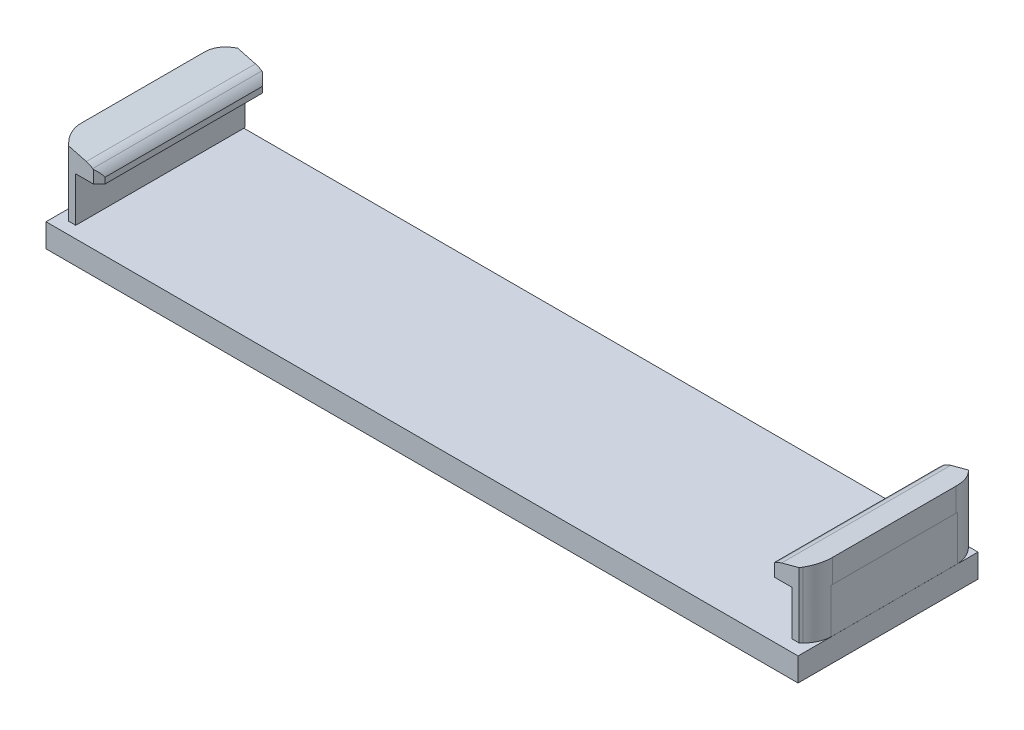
ISO-10303-21;
HEADER;
FILE_DESCRIPTION(('STEP AP214'),'2;1');
FILE_NAME('part.step','',(''),(''),'','','');
FILE_SCHEMA(('AUTOMOTIVE_DESIGN { 1 0 10303 214 1 1 1 1 }'));
ENDSEC;
DATA;
#1=APPLICATION_CONTEXT('core data for automotive mechanical design processes');
#2=APPLICATION_PROTOCOL_DEFINITION('international standard','automotive_design',2000,#1);
#3=PRODUCT_CONTEXT('',#1,'mechanical');
#4=PRODUCT('Part','Part','',(#3));
#5=PRODUCT_RELATED_PRODUCT_CATEGORY('part','',(#4));
#6=PRODUCT_DEFINITION_FORMATION('','',#4);
#7=PRODUCT_DEFINITION_CONTEXT('part definition',#1,'design');
#8=PRODUCT_DEFINITION('design','',#6,#7);
#9=PRODUCT_DEFINITION_SHAPE('','',#8);
#10=(LENGTH_UNIT() NAMED_UNIT(*) SI_UNIT(.MILLI.,.METRE.));
#11=(NAMED_UNIT(*) PLANE_ANGLE_UNIT() SI_UNIT($,.RADIAN.));
#12=(NAMED_UNIT(*) SI_UNIT($,.STERADIAN.) SOLID_ANGLE_UNIT());
#13=UNCERTAINTY_MEASURE_WITH_UNIT(LENGTH_MEASURE(1.E-05),#10,'distance_accuracy_value','');
#14=(GEOMETRIC_REPRESENTATION_CONTEXT(3) GLOBAL_UNCERTAINTY_ASSIGNED_CONTEXT((#13)) GLOBAL_UNIT_ASSIGNED_CONTEXT((#10,
#11,#12)) REPRESENTATION_CONTEXT('',''));
#15=CARTESIAN_POINT('',(0.,0.,0.));
#16=DIRECTION('',(0.,0.,1.));
#17=DIRECTION('',(1.,0.,0.));
#18=AXIS2_PLACEMENT_3D('',#15,#16,#17);
#19=CARTESIAN_POINT('',(32.0000015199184,3.,0.));
#20=DIRECTION('',(0.,0.,1.));
#21=DIRECTION('',(1.,0.,0.));
#22=AXIS2_PLACEMENT_3D('',#19,#20,#21);
#23=PLANE('',#22);
#24=DIRECTION('',(0.,-1.,0.));
#25=VECTOR('',#24,1.);
#26=CARTESIAN_POINT('',(31.0999993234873,8.79998955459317,0.));
#27=LINE('',#26,#25);
#28=CARTESIAN_POINT('',(31.0999993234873,8.55883867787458,0.));
#29=VERTEX_POINT('',#28);
#30=CARTESIAN_POINT('',(31.0999993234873,3.,0.));
#31=VERTEX_POINT('',#30);
#32=EDGE_CURVE('E514',#29,#31,#27,.T.);
#33=ORIENTED_EDGE('',*,*,#32,.T.);
#34=DIRECTION('',(-1.,0.,0.));
#35=VECTOR('',#34,1.);
#36=CARTESIAN_POINT('',(32.0000015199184,3.,0.));
#37=LINE('',#36,#35);
#38=CARTESIAN_POINT('',(30.5000003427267,3.,0.));
#39=VERTEX_POINT('',#38);
#40=EDGE_CURVE('E487',#31,#39,#37,.T.);
#41=ORIENTED_EDGE('',*,*,#40,.T.);
#42=DIRECTION('',(0.,-1.,0.));
#43=VECTOR('',#42,1.);
#44=CARTESIAN_POINT('',(30.5000003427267,6.8,0.));
#45=LINE('',#44,#43);
#46=CARTESIAN_POINT('',(30.5000003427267,6.80000009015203,0.));
#47=VERTEX_POINT('',#46);
#48=EDGE_CURVE('E318',#47,#39,#45,.T.);
#49=ORIENTED_EDGE('',*,*,#48,.F.);
#50=DIRECTION('',(1.,0.,0.));
#51=VECTOR('',#50,1.);
#52=CARTESIAN_POINT('',(32.0000015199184,6.80000009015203,0.));
#53=LINE('',#52,#51);
#54=CARTESIAN_POINT('',(28.999999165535,6.80000009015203,0.));
#55=VERTEX_POINT('',#54);
#56=EDGE_CURVE('E539',#55,#47,#53,.T.);
#57=ORIENTED_EDGE('',*,*,#56,.F.);
#58=DIRECTION('',(0.,-1.,0.));
#59=VECTOR('',#58,1.);
#60=CARTESIAN_POINT('',(28.999999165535,8.79998955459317,0.));
#61=LINE('',#60,#59);
#62=CARTESIAN_POINT('',(28.999999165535,7.86790985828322,0.));
#63=VERTEX_POINT('',#62);
#64=EDGE_CURVE('E497',#63,#55,#61,.T.);
#65=ORIENTED_EDGE('',*,*,#64,.F.);
#66=CARTESIAN_POINT('',(30.0633864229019,6.42762273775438,0.));
#67=DIRECTION('',(0.,0.,1.));
#68=DIRECTION('',(-1.,0.,0.));
#69=AXIS2_PLACEMENT_3D('',#66,#67,#68);
#70=CIRCLE('',#69,1.79031266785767);
#71=CARTESIAN_POINT('',(29.0544796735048,7.9065840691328,0.));
#72=VERTEX_POINT('',#71);
#73=EDGE_CURVE('E547',#72,#63,#70,.T.);
#74=ORIENTED_EDGE('',*,*,#73,.F.);
#75=CARTESIAN_POINT('',(30.0633373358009,6.42769469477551,0.));
#76=DIRECTION('',(0.,0.,1.));
#77=DIRECTION('',(-1.,0.,0.));
#78=AXIS2_PLACEMENT_3D('',#75,#76,#77);
#79=CIRCLE('',#78,1.79022556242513);
#80=CARTESIAN_POINT('',(29.6000000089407,8.1569217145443,0.));
#81=VERTEX_POINT('',#80);
#82=EDGE_CURVE('E304',#81,#72,#79,.T.);
#83=ORIENTED_EDGE('',*,*,#82,.F.);
#84=DIRECTION('',(-0.965926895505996,-0.258815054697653,0.));
#85=VECTOR('',#84,1.);
#86=CARTESIAN_POINT('',(29.6000000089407,8.1569217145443,0.));
#87=LINE('',#86,#85);
#88=EDGE_CURVE('E299',#29,#81,#87,.T.);
#89=ORIENTED_EDGE('',*,*,#88,.F.);
#90=EDGE_LOOP('',(#33,#41,#49,#57,#65,#74,#83,#89));
#91=FACE_BOUND('',#90,.T.);
#92=ADVANCED_FACE('F46',(#91),#23,.F.);
#93=CARTESIAN_POINT('',(32.0000015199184,3.,14.3999997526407));
#94=DIRECTION('',(0.,0.,-1.));
#95=DIRECTION('',(-1.,0.,0.));
#96=AXIS2_PLACEMENT_3D('',#93,#94,#95);
#97=PLANE('',#96);
#98=DIRECTION('',(0.,-1.,0.));
#99=VECTOR('',#98,1.);
#100=CARTESIAN_POINT('',(-31.0999993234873,8.79998955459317,14.3999997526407));
#101=LINE('',#100,#99);
#102=CARTESIAN_POINT('',(-31.0999993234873,8.55883867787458,14.3999997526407));
#103=VERTEX_POINT('',#102);
#104=CARTESIAN_POINT('',(-31.0999993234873,3.,14.3999997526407));
#105=VERTEX_POINT('',#104);
#106=EDGE_CURVE('E344',#103,#105,#101,.T.);
#107=ORIENTED_EDGE('',*,*,#106,.T.);
#108=DIRECTION('',(1.,0.,0.));
#109=VECTOR('',#108,1.);
#110=CARTESIAN_POINT('',(32.0000015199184,3.,14.3999997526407));
#111=LINE('',#110,#109);
#112=CARTESIAN_POINT('',(-30.5000003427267,3.,14.3999997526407));
#113=VERTEX_POINT('',#112);
#114=EDGE_CURVE('E489',#105,#113,#111,.T.);
#115=ORIENTED_EDGE('',*,*,#114,.T.);
#116=DIRECTION('',(0.,-1.,0.));
#117=VECTOR('',#116,1.);
#118=CARTESIAN_POINT('',(-30.5000003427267,6.8,14.3999997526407));
#119=LINE('',#118,#117);
#120=CARTESIAN_POINT('',(-30.5000003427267,6.8,14.3999997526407));
#121=VERTEX_POINT('',#120);
#122=EDGE_CURVE('E428',#121,#113,#119,.T.);
#123=ORIENTED_EDGE('',*,*,#122,.F.);
#124=DIRECTION('',(1.,0.,0.));
#125=VECTOR('',#124,1.);
#126=CARTESIAN_POINT('',(-32.0000015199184,6.80000009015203,14.3999997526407));
#127=LINE('',#126,#125);
#128=CARTESIAN_POINT('',(-28.999999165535,6.80000009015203,14.3999997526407));
#129=VERTEX_POINT('',#128);
#130=EDGE_CURVE('E389',#121,#129,#127,.T.);
#131=ORIENTED_EDGE('',*,*,#130,.T.);
#132=DIRECTION('',(0.,-1.,0.));
#133=VECTOR('',#132,1.);
#134=CARTESIAN_POINT('',(-28.999999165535,8.79998955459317,14.3999997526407));
#135=LINE('',#134,#133);
#136=CARTESIAN_POINT('',(-28.999999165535,7.86790985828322,14.3999997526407));
#137=VERTEX_POINT('',#136);
#138=EDGE_CURVE('E330',#137,#129,#135,.T.);
#139=ORIENTED_EDGE('',*,*,#138,.F.);
#140=CARTESIAN_POINT('',(-30.0633864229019,6.42762273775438,14.3999997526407));
#141=DIRECTION('',(0.,0.,-1.));
#142=DIRECTION('',(-1.,0.,0.));
#143=AXIS2_PLACEMENT_3D('',#140,#141,#142);
#144=CIRCLE('',#143,1.79031266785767);
#145=CARTESIAN_POINT('',(-29.0544796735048,7.9065840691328,14.3999997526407));
#146=VERTEX_POINT('',#145);
#147=EDGE_CURVE('E386',#137,#146,#144,.F.);
#148=ORIENTED_EDGE('',*,*,#147,.T.);
#149=CARTESIAN_POINT('',(-30.0633373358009,6.42769469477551,14.3999997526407));
#150=DIRECTION('',(0.,0.,-1.));
#151=DIRECTION('',(-1.,0.,0.));
#152=AXIS2_PLACEMENT_3D('',#149,#150,#151);
#153=CIRCLE('',#152,1.79022556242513);
#154=CARTESIAN_POINT('',(-29.6000000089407,8.1569217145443,14.3999997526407));
#155=VERTEX_POINT('',#154);
#156=EDGE_CURVE('E384',#146,#155,#153,.F.);
#157=ORIENTED_EDGE('',*,*,#156,.T.);
#158=DIRECTION('',(-0.965926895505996,0.258815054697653,0.));
#159=VECTOR('',#158,1.);
#160=CARTESIAN_POINT('',(-29.6000000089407,8.1569217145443,14.3999997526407));
#161=LINE('',#160,#159);
#162=EDGE_CURVE('E392',#155,#103,#161,.T.);
#163=ORIENTED_EDGE('',*,*,#162,.T.);
#164=EDGE_LOOP('',(#107,#115,#123,#131,#139,#148,#157,#163));
#165=FACE_BOUND('',#164,.T.);
#166=ADVANCED_FACE('F682',(#165),#97,.F.);
#167=DIRECTION('',(0.,-1.,0.));
#168=VECTOR('',#167,1.);
#169=CARTESIAN_POINT('',(-30.5000003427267,6.8,0.));
#170=LINE('',#169,#168);
#171=CARTESIAN_POINT('',(-30.5000003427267,6.8,0.));
#172=VERTEX_POINT('',#171);
#173=CARTESIAN_POINT('',(-30.5000003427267,3.,0.));
#174=VERTEX_POINT('',#173);
#175=EDGE_CURVE('E435',#172,#174,#170,.T.);
#176=ORIENTED_EDGE('',*,*,#175,.T.);
#177=CARTESIAN_POINT('',(-31.0999993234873,3.,0.));
#178=VERTEX_POINT('',#177);
#179=EDGE_CURVE('E491',#174,#178,#37,.T.);
#180=ORIENTED_EDGE('',*,*,#179,.T.);
#181=DIRECTION('',(0.,-1.,0.));
#182=VECTOR('',#181,1.);
#183=CARTESIAN_POINT('',(-31.0999993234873,8.79998955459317,0.));
#184=LINE('',#183,#182);
#185=CARTESIAN_POINT('',(-31.0999993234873,8.55883867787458,0.));
#186=VERTEX_POINT('',#185);
#187=EDGE_CURVE('E355',#186,#178,#184,.T.);
#188=ORIENTED_EDGE('',*,*,#187,.F.);
#189=DIRECTION('',(0.965926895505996,-0.258815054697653,0.));
#190=VECTOR('',#189,1.);
#191=CARTESIAN_POINT('',(-29.6000000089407,8.1569217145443,0.));
#192=LINE('',#191,#190);
#193=CARTESIAN_POINT('',(-29.6000000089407,8.1569217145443,0.));
#194=VERTEX_POINT('',#193);
#195=EDGE_CURVE('E383',#186,#194,#192,.T.);
#196=ORIENTED_EDGE('',*,*,#195,.T.);
#197=CARTESIAN_POINT('',(-30.0633373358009,6.42769469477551,0.));
#198=DIRECTION('',(0.,0.,-1.));
#199=DIRECTION('',(1.,0.,0.));
#200=AXIS2_PLACEMENT_3D('',#197,#198,#199);
#201=CIRCLE('',#200,1.79022556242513);
#202=CARTESIAN_POINT('',(-29.0544796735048,7.9065840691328,0.));
#203=VERTEX_POINT('',#202);
#204=EDGE_CURVE('E394',#194,#203,#201,.T.);
#205=ORIENTED_EDGE('',*,*,#204,.T.);
#206=CARTESIAN_POINT('',(-30.0633864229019,6.42762273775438,0.));
#207=DIRECTION('',(0.,0.,-1.));
#208=DIRECTION('',(1.,0.,0.));
#209=AXIS2_PLACEMENT_3D('',#206,#207,#208);
#210=CIRCLE('',#209,1.79031266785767);
#211=CARTESIAN_POINT('',(-28.999999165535,7.86790985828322,0.));
#212=VERTEX_POINT('',#211);
#213=EDGE_CURVE('E397',#203,#212,#210,.T.);
#214=ORIENTED_EDGE('',*,*,#213,.T.);
#215=DIRECTION('',(0.,-1.,0.));
#216=VECTOR('',#215,1.);
#217=CARTESIAN_POINT('',(-28.999999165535,8.79998955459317,0.));
#218=LINE('',#217,#216);
#219=CARTESIAN_POINT('',(-28.999999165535,6.80000009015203,0.));
#220=VERTEX_POINT('',#219);
#221=EDGE_CURVE('E333',#212,#220,#218,.T.);
#222=ORIENTED_EDGE('',*,*,#221,.T.);
#223=DIRECTION('',(-1.,0.,0.));
#224=VECTOR('',#223,1.);
#225=CARTESIAN_POINT('',(-32.0000015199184,6.80000009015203,0.));
#226=LINE('',#225,#224);
#227=EDGE_CURVE('E400',#220,#172,#226,.T.);
#228=ORIENTED_EDGE('',*,*,#227,.T.);
#229=EDGE_LOOP('',(#176,#180,#188,#196,#205,#214,#222,#228));
#230=FACE_BOUND('',#229,.T.);
#231=ADVANCED_FACE('F684',(#230),#23,.F.);
#232=DIRECTION('',(0.,-1.,0.));
#233=VECTOR('',#232,1.);
#234=CARTESIAN_POINT('',(30.5000003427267,6.8,14.3999997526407));
#235=LINE('',#234,#233);
#236=CARTESIAN_POINT('',(30.5000003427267,6.8,14.3999997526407));
#237=VERTEX_POINT('',#236);
#238=CARTESIAN_POINT('',(30.5000003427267,3.,14.3999997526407));
#239=VERTEX_POINT('',#238);
#240=EDGE_CURVE('E327',#237,#239,#235,.T.);
#241=ORIENTED_EDGE('',*,*,#240,.T.);
#242=CARTESIAN_POINT('',(31.0999993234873,3.,14.3999997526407));
#243=VERTEX_POINT('',#242);
#244=EDGE_CURVE('E492',#239,#243,#111,.T.);
#245=ORIENTED_EDGE('',*,*,#244,.T.);
#246=DIRECTION('',(0.,-1.,0.));
#247=VECTOR('',#246,1.);
#248=CARTESIAN_POINT('',(31.0999993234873,8.79998955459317,14.3999997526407));
#249=LINE('',#248,#247);
#250=CARTESIAN_POINT('',(31.0999993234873,8.55883867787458,14.3999997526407));
#251=VERTEX_POINT('',#250);
#252=EDGE_CURVE('E292',#251,#243,#249,.T.);
#253=ORIENTED_EDGE('',*,*,#252,.F.);
#254=DIRECTION('',(0.965926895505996,0.258815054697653,0.));
#255=VECTOR('',#254,1.);
#256=CARTESIAN_POINT('',(29.6000000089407,8.1569217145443,14.3999997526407));
#257=LINE('',#256,#255);
#258=CARTESIAN_POINT('',(29.6000000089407,8.1569217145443,14.3999997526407));
#259=VERTEX_POINT('',#258);
#260=EDGE_CURVE('E322',#259,#251,#257,.T.);
#261=ORIENTED_EDGE('',*,*,#260,.F.);
#262=CARTESIAN_POINT('',(30.0633373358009,6.42769469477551,14.3999997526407));
#263=DIRECTION('',(0.,0.,-1.));
#264=DIRECTION('',(-1.,0.,0.));
#265=AXIS2_PLACEMENT_3D('',#262,#263,#264);
#266=CIRCLE('',#265,1.79022556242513);
#267=CARTESIAN_POINT('',(29.0544796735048,7.9065840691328,14.3999997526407));
#268=VERTEX_POINT('',#267);
#269=EDGE_CURVE('E541',#268,#259,#266,.T.);
#270=ORIENTED_EDGE('',*,*,#269,.F.);
#271=CARTESIAN_POINT('',(30.0633864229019,6.42762273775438,14.3999997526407));
#272=DIRECTION('',(0.,0.,-1.));
#273=DIRECTION('',(-1.,0.,0.));
#274=AXIS2_PLACEMENT_3D('',#271,#272,#273);
#275=CIRCLE('',#274,1.79031266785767);
#276=CARTESIAN_POINT('',(28.999999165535,7.86790985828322,14.3999997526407));
#277=VERTEX_POINT('',#276);
#278=EDGE_CURVE('E311',#277,#268,#275,.T.);
#279=ORIENTED_EDGE('',*,*,#278,.F.);
#280=DIRECTION('',(0.,-1.,0.));
#281=VECTOR('',#280,1.);
#282=CARTESIAN_POINT('',(28.999999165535,8.79998955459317,14.3999997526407));
#283=LINE('',#282,#281);
#284=CARTESIAN_POINT('',(28.999999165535,6.80000009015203,14.3999997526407));
#285=VERTEX_POINT('',#284);
#286=EDGE_CURVE('E63',#277,#285,#283,.T.);
#287=ORIENTED_EDGE('',*,*,#286,.T.);
#288=DIRECTION('',(-1.,0.,0.));
#289=VECTOR('',#288,1.);
#290=CARTESIAN_POINT('',(32.0000015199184,6.80000009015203,14.3999997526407));
#291=LINE('',#290,#289);
#292=EDGE_CURVE('E308',#237,#285,#291,.T.);
#293=ORIENTED_EDGE('',*,*,#292,.F.);
#294=EDGE_LOOP('',(#241,#245,#253,#261,#270,#279,#287,#293));
#295=FACE_BOUND('',#294,.T.);
#296=ADVANCED_FACE('F579',(#295),#97,.F.);
#297=CARTESIAN_POINT('',(-31.9968168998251,6.8,14.3999997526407));
#298=DIRECTION('',(1.,0.,0.));
#299=DIRECTION('',(0.,0.,-1.));
#300=AXIS2_PLACEMENT_3D('',#297,#298,#299);
#301=PLANE('',#300);
#302=DIRECTION('',(0.,-1.,0.));
#303=VECTOR('',#302,1.);
#304=CARTESIAN_POINT('',(-31.9968168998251,8.79998955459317,12.5906058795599));
#305=LINE('',#304,#303);
#306=CARTESIAN_POINT('',(-31.9968168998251,6.80000009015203,12.5906058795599));
#307=VERTEX_POINT('',#306);
#308=CARTESIAN_POINT('',(-31.9968168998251,3.,12.5906058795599));
#309=VERTEX_POINT('',#308);
#310=EDGE_CURVE('E369',#307,#309,#305,.T.);
#311=ORIENTED_EDGE('',*,*,#310,.F.);
#312=DIRECTION('',(0.,0.,1.));
#313=VECTOR('',#312,1.);
#314=CARTESIAN_POINT('',(-31.9968168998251,6.8,14.3999997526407));
#315=LINE('',#314,#313);
#316=CARTESIAN_POINT('',(-31.9968168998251,6.80000009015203,1.80938703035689));
#317=VERTEX_POINT('',#316);
#318=EDGE_CURVE('E424',#317,#307,#315,.T.);
#319=ORIENTED_EDGE('',*,*,#318,.F.);
#320=DIRECTION('',(0.,-1.,0.));
#321=VECTOR('',#320,1.);
#322=CARTESIAN_POINT('',(-31.9968168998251,8.79998955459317,1.80938703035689));
#323=LINE('',#322,#321);
#324=CARTESIAN_POINT('',(-31.9968168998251,3.,1.80938703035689));
#325=VERTEX_POINT('',#324);
#326=EDGE_CURVE('E364',#325,#317,#323,.F.);
#327=ORIENTED_EDGE('',*,*,#326,.F.);
#328=DIRECTION('',(0.,0.,1.));
#329=VECTOR('',#328,1.);
#330=CARTESIAN_POINT('',(-31.9968168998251,3.,14.3999997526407));
#331=LINE('',#330,#329);
#332=EDGE_CURVE('E425',#325,#309,#331,.T.);
#333=ORIENTED_EDGE('',*,*,#332,.T.);
#334=EDGE_LOOP('',(#311,#319,#327,#333));
#335=FACE_BOUND('',#334,.T.);
#336=ADVANCED_FACE('F698',(#335),#301,.F.);
#337=CARTESIAN_POINT('',(-32.0000015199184,6.80000009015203,18.4311247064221));
#338=DIRECTION('',(0.,-1.,0.));
#339=DIRECTION('',(0.,0.,-1.));
#340=AXIS2_PLACEMENT_3D('',#337,#338,#339);
#341=PLANE('',#340);
#342=ORIENTED_EDGE('',*,*,#227,.F.);
#343=DIRECTION('',(0.707106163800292,0.,0.707107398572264));
#344=VECTOR('',#343,1.);
#345=CARTESIAN_POINT('',(-21.2844353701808,6.80000009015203,7.71557726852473));
#346=LINE('',#345,#344);
#347=CARTESIAN_POINT('',(-28.5000000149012,6.80000009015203,0.500000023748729));
#348=VERTEX_POINT('',#347);
#349=EDGE_CURVE('E380',#220,#348,#346,.T.);
#350=ORIENTED_EDGE('',*,*,#349,.T.);
#351=DIRECTION('',(0.,0.,-1.));
#352=VECTOR('',#351,1.);
#353=CARTESIAN_POINT('',(-28.5000000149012,6.80000009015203,18.4311247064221));
#354=LINE('',#353,#352);
#355=CARTESIAN_POINT('',(-28.5000000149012,6.80000009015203,13.9000006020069));
#356=VERTEX_POINT('',#355);
#357=EDGE_CURVE('E405',#356,#348,#354,.T.);
#358=ORIENTED_EDGE('',*,*,#357,.F.);
#359=DIRECTION('',(-0.707106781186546,0.,0.707106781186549));
#360=VECTOR('',#359,1.);
#361=CARTESIAN_POINT('',(-32.5155628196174,6.80000009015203,17.9155634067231));
#362=LINE('',#361,#360);
#363=EDGE_CURVE('E374',#356,#129,#362,.T.);
#364=ORIENTED_EDGE('',*,*,#363,.T.);
#365=ORIENTED_EDGE('',*,*,#130,.F.);
#366=DIRECTION('',(0.,0.,-1.));
#367=VECTOR('',#366,1.);
#368=CARTESIAN_POINT('',(-30.5000003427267,6.8,14.3999997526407));
#369=LINE('',#368,#367);
#370=EDGE_CURVE('E421',#121,#172,#369,.T.);
#371=ORIENTED_EDGE('',*,*,#370,.T.);
#372=EDGE_LOOP('',(#342,#350,#358,#364,#365,#371));
#373=FACE_BOUND('',#372,.T.);
#374=ADVANCED_FACE('F710',(#373),#341,.T.);
#375=CARTESIAN_POINT('',(-32.0000015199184,8.79998955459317,18.4311247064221));
#376=DIRECTION('',(-1.,0.,0.));
#377=DIRECTION('',(0.,0.,1.));
#378=AXIS2_PLACEMENT_3D('',#375,#376,#377);
#379=PLANE('',#378);
#380=DIRECTION('',(0.,0.,-1.));
#381=VECTOR('',#380,1.);
#382=CARTESIAN_POINT('',(-32.0000015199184,6.80000009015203,18.4311247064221));
#383=LINE('',#382,#381);
#384=CARTESIAN_POINT('',(-32.0000015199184,6.80000009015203,12.4644665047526));
#385=VERTEX_POINT('',#384);
#386=CARTESIAN_POINT('',(-32.0000015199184,6.80000009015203,1.93553394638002));
#387=VERTEX_POINT('',#386);
#388=EDGE_CURVE('E387',#385,#387,#383,.T.);
#389=ORIENTED_EDGE('',*,*,#388,.F.);
#390=DIRECTION('',(0.,-1.,0.));
#391=VECTOR('',#390,1.);
#392=CARTESIAN_POINT('',(-32.0000015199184,8.79998955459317,12.4644665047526));
#393=LINE('',#392,#391);
#394=CARTESIAN_POINT('',(-32.0000015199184,8.79998955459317,12.4644665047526));
#395=VERTEX_POINT('',#394);
#396=EDGE_CURVE('E336',#395,#385,#393,.T.);
#397=ORIENTED_EDGE('',*,*,#396,.F.);
#398=DIRECTION('',(0.,0.,-1.));
#399=VECTOR('',#398,1.);
#400=CARTESIAN_POINT('',(-32.0000015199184,8.79998955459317,18.4311247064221));
#401=LINE('',#400,#399);
#402=CARTESIAN_POINT('',(-32.0000015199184,8.79998955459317,1.93553394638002));
#403=VERTEX_POINT('',#402);
#404=EDGE_CURVE('E402',#395,#403,#401,.T.);
#405=ORIENTED_EDGE('',*,*,#404,.T.);
#406=DIRECTION('',(0.,-1.,0.));
#407=VECTOR('',#406,1.);
#408=CARTESIAN_POINT('',(-32.0000015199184,8.79998955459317,1.93553394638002));
#409=LINE('',#408,#407);
#410=EDGE_CURVE('E352',#403,#387,#409,.T.);
#411=ORIENTED_EDGE('',*,*,#410,.T.);
#412=EDGE_LOOP('',(#389,#397,#405,#411));
#413=FACE_BOUND('',#412,.T.);
#414=ADVANCED_FACE('F732',(#413),#379,.T.);
#415=ORIENTED_EDGE('',*,*,#318,.T.);
#416=CARTESIAN_POINT('',(-29.4999903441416,6.80000009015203,12.464459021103));
#417=DIRECTION('',(0.,-1.,0.));
#418=DIRECTION('',(0.,0.,-1.));
#419=AXIS2_PLACEMENT_3D('',#416,#417,#418);
#420=CIRCLE('',#419,2.500011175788);
#421=EDGE_CURVE('E366',#307,#385,#420,.T.);
#422=ORIENTED_EDGE('',*,*,#421,.T.);
#423=ORIENTED_EDGE('',*,*,#388,.T.);
#424=CARTESIAN_POINT('',(-29.5000088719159,6.80000009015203,1.93553342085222));
#425=DIRECTION('',(0.,-1.,0.));
#426=DIRECTION('',(0.,0.,-1.));
#427=AXIS2_PLACEMENT_3D('',#424,#425,#426);
#428=CIRCLE('',#427,2.4999926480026);
#429=EDGE_CURVE('E361',#387,#317,#428,.T.);
#430=ORIENTED_EDGE('',*,*,#429,.T.);
#431=EDGE_LOOP('',(#415,#422,#423,#430));
#432=FACE_BOUND('',#431,.T.);
#433=ADVANCED_FACE('F726',(#432),#341,.T.);
#434=CARTESIAN_POINT('',(-28.5000000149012,6.80000009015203,18.4311247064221));
#435=DIRECTION('',(1.,0.,0.));
#436=DIRECTION('',(0.,0.,-1.));
#437=AXIS2_PLACEMENT_3D('',#434,#435,#436);
#438=PLANE('',#437);
#439=ORIENTED_EDGE('',*,*,#357,.T.);
#440=DIRECTION('',(0.,1.,0.));
#441=VECTOR('',#440,1.);
#442=CARTESIAN_POINT('',(-28.5000000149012,6.80000009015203,0.500000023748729));
#443=LINE('',#442,#441);
#444=CARTESIAN_POINT('',(-28.5000000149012,7.30000017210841,0.500000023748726));
#445=VERTEX_POINT('',#444);
#446=EDGE_CURVE('E377',#348,#445,#443,.T.);
#447=ORIENTED_EDGE('',*,*,#446,.T.);
#448=DIRECTION('',(0.,0.,-1.));
#449=VECTOR('',#448,1.);
#450=CARTESIAN_POINT('',(-28.5000000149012,7.30000017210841,18.4311247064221));
#451=LINE('',#450,#449);
#452=CARTESIAN_POINT('',(-28.5000000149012,7.30000017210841,13.9000006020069));
#453=VERTEX_POINT('',#452);
#454=EDGE_CURVE('E408',#453,#445,#451,.T.);
#455=ORIENTED_EDGE('',*,*,#454,.F.);
#456=DIRECTION('',(0.,-1.,0.));
#457=VECTOR('',#456,1.);
#458=CARTESIAN_POINT('',(-28.5000000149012,6.80000009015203,13.9000006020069));
#459=LINE('',#458,#457);
#460=EDGE_CURVE('E371',#453,#356,#459,.T.);
#461=ORIENTED_EDGE('',*,*,#460,.T.);
#462=EDGE_LOOP('',(#439,#447,#455,#461));
#463=FACE_BOUND('',#462,.T.);
#464=ADVANCED_FACE('F1066',(#463),#438,.T.);
#465=CARTESIAN_POINT('',(-30.0633864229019,6.42762273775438,18.4311247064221));
#466=DIRECTION('',(0.,0.,-1.));
#467=DIRECTION('',(-1.,0.,0.));
#468=AXIS2_PLACEMENT_3D('',#465,#466,#467);
#469=CYLINDRICAL_SURFACE('',#468,1.79031266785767);
#470=ORIENTED_EDGE('',*,*,#454,.T.);
#471=CARTESIAN_POINT('',(-30.0633864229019,6.42762273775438,-1.06338911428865));
#472=DIRECTION('',(0.707107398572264,0.,-0.707106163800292));
#473=DIRECTION('',(-0.707106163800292,0.,-0.707107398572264));
#474=AXIS2_PLACEMENT_3D('',#471,#472,#473);
#475=ELLIPSE('',#474,2.53188666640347,1.79031266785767);
#476=EDGE_CURVE('E456',#445,#212,#475,.F.);
#477=ORIENTED_EDGE('',*,*,#476,.T.);
#478=ORIENTED_EDGE('',*,*,#213,.F.);
#479=DIRECTION('',(0.,0.,-1.));
#480=VECTOR('',#479,1.);
#481=CARTESIAN_POINT('',(-29.0544796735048,7.9065840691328,18.4311247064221));
#482=LINE('',#481,#480);
#483=EDGE_CURVE('E411',#146,#203,#482,.T.);
#484=ORIENTED_EDGE('',*,*,#483,.F.);
#485=ORIENTED_EDGE('',*,*,#147,.F.);
#486=CARTESIAN_POINT('',(-30.0633864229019,6.42762273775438,15.4633870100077));
#487=DIRECTION('',(0.707106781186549,0.,0.707106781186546));
#488=DIRECTION('',(0.707106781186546,0.,-0.707106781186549));
#489=AXIS2_PLACEMENT_3D('',#486,#487,#488);
#490=ELLIPSE('',#489,2.53188445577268,1.79031266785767);
#491=EDGE_CURVE('E453',#137,#453,#490,.F.);
#492=ORIENTED_EDGE('',*,*,#491,.T.);
#493=EDGE_LOOP('',(#470,#477,#478,#484,#485,#492));
#494=FACE_BOUND('',#493,.T.);
#495=ADVANCED_FACE('F1074',(#494),#469,.T.);
#496=CARTESIAN_POINT('',(-29.6000000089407,8.1569217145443,18.4311247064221));
#497=DIRECTION('',(0.258815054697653,0.965926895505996,0.));
#498=DIRECTION('',(-0.965926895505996,0.258815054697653,0.));
#499=AXIS2_PLACEMENT_3D('',#496,#497,#498);
#500=PLANE('',#499);
#501=ORIENTED_EDGE('',*,*,#404,.F.);
#502=CARTESIAN_POINT('',(-29.4999903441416,8.13012464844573,12.464459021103));
#503=DIRECTION('',(0.258815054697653,0.965926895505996,0.));
#504=DIRECTION('',(0.965926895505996,-0.258815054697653,0.));
#505=AXIS2_PLACEMENT_3D('',#502,#503,#504);
#506=ELLIPSE('',#505,2.58819915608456,2.500011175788);
#507=CARTESIAN_POINT('',(-31.2677659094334,8.60379085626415,14.2322331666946));
#508=VERTEX_POINT('',#507);
#509=EDGE_CURVE('E450',#395,#508,#506,.T.);
#510=ORIENTED_EDGE('',*,*,#509,.T.);
#511=DIRECTION('',(0.694746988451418,-0.186153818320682,0.694746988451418));
#512=VECTOR('',#511,1.);
#513=CARTESIAN_POINT('',(-28.3782930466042,7.82957173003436,17.1217060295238));
#514=LINE('',#513,#512);
#515=EDGE_CURVE('E447',#508,#103,#514,.T.);
#516=ORIENTED_EDGE('',*,*,#515,.T.);
#517=ORIENTED_EDGE('',*,*,#162,.F.);
#518=DIRECTION('',(0.,0.,-1.));
#519=VECTOR('',#518,1.);
#520=CARTESIAN_POINT('',(-29.6000000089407,8.1569217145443,18.4311247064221));
#521=LINE('',#520,#519);
#522=EDGE_CURVE('E413',#155,#194,#521,.T.);
#523=ORIENTED_EDGE('',*,*,#522,.T.);
#524=ORIENTED_EDGE('',*,*,#195,.F.);
#525=DIRECTION('',(-0.694746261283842,0.186153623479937,0.694747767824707));
#526=VECTOR('',#525,1.);
#527=CARTESIAN_POINT('',(-39.2202252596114,10.7346107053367,8.12024354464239));
#528=LINE('',#527,#526);
#529=CARTESIAN_POINT('',(-31.2677659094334,8.60379085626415,0.167766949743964));
#530=VERTEX_POINT('',#529);
#531=EDGE_CURVE('E441',#186,#530,#528,.T.);
#532=ORIENTED_EDGE('',*,*,#531,.T.);
#533=CARTESIAN_POINT('',(-29.5000088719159,8.13012961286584,1.93553342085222));
#534=DIRECTION('',(0.258815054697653,0.965926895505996,0.));
#535=DIRECTION('',(0.965926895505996,-0.258815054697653,0.));
#536=AXIS2_PLACEMENT_3D('',#533,#534,#535);
#537=ELLIPSE('',#536,2.5881799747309,2.4999926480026);
#538=EDGE_CURVE('E444',#530,#403,#537,.T.);
#539=ORIENTED_EDGE('',*,*,#538,.T.);
#540=EDGE_LOOP('',(#501,#510,#516,#517,#523,#524,#532,#539));
#541=FACE_BOUND('',#540,.T.);
#542=ADVANCED_FACE('F736',(#541),#500,.T.);
#543=CARTESIAN_POINT('',(32.0000015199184,3.,14.3999997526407));
#544=DIRECTION('',(-1.,0.,0.));
#545=DIRECTION('',(0.,0.,1.));
#546=AXIS2_PLACEMENT_3D('',#543,#544,#545);
#547=PLANE('',#546);
#548=DIRECTION('',(0.,0.,-1.));
#549=VECTOR('',#548,1.);
#550=CARTESIAN_POINT('',(32.0000015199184,1.,14.3999997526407));
#551=LINE('',#550,#549);
#552=CARTESIAN_POINT('',(32.0000015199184,1.,15.3999997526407));
#553=VERTEX_POINT('',#552);
#554=CARTESIAN_POINT('',(32.0000015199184,1.,0.0802564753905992));
#555=VERTEX_POINT('',#554);
#556=EDGE_CURVE('E86',#553,#555,#551,.T.);
#557=ORIENTED_EDGE('',*,*,#556,.T.);
#558=DIRECTION('',(0.,1.,0.));
#559=VECTOR('',#558,1.);
#560=CARTESIAN_POINT('',(32.0000015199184,3.,0.0802564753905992));
#561=LINE('',#560,#559);
#562=CARTESIAN_POINT('',(32.0000015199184,3.,0.0802564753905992));
#563=VERTEX_POINT('',#562);
#564=EDGE_CURVE('E472',#555,#563,#561,.T.);
#565=ORIENTED_EDGE('',*,*,#564,.T.);
#566=DIRECTION('',(0.,0.,-1.));
#567=VECTOR('',#566,1.);
#568=CARTESIAN_POINT('',(32.0000015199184,3.,14.3999997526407));
#569=LINE('',#568,#567);
#570=CARTESIAN_POINT('',(32.0000015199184,3.,15.3999997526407));
#571=VERTEX_POINT('',#570);
#572=EDGE_CURVE('E94',#571,#563,#569,.T.);
#573=ORIENTED_EDGE('',*,*,#572,.F.);
#574=DIRECTION('',(0.,-1.,0.));
#575=VECTOR('',#574,1.);
#576=CARTESIAN_POINT('',(32.0000015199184,78.604084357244,15.3999997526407));
#577=LINE('',#576,#575);
#578=EDGE_CURVE('E471',#571,#553,#577,.T.);
#579=ORIENTED_EDGE('',*,*,#578,.T.);
#580=EDGE_LOOP('',(#557,#565,#573,#579));
#581=FACE_BOUND('',#580,.T.);
#582=ADVANCED_FACE('F631',(#581),#547,.F.);
#583=CARTESIAN_POINT('',(-32.0307534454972,3.,14.3999997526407));
#584=DIRECTION('',(1.,0.,0.));
#585=DIRECTION('',(0.,0.,-1.));
#586=AXIS2_PLACEMENT_3D('',#583,#584,#585);
#587=PLANE('',#586);
#588=DIRECTION('',(0.,0.,1.));
#589=VECTOR('',#588,1.);
#590=CARTESIAN_POINT('',(-32.0307534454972,3.,14.3999997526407));
#591=LINE('',#590,#589);
#592=CARTESIAN_POINT('',(-32.0307534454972,3.,0.0802564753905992));
#593=VERTEX_POINT('',#592);
#594=CARTESIAN_POINT('',(-32.0307534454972,3.,15.3999997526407));
#595=VERTEX_POINT('',#594);
#596=EDGE_CURVE('E439',#593,#595,#591,.T.);
#597=ORIENTED_EDGE('',*,*,#596,.F.);
#598=DIRECTION('',(0.,-1.,0.));
#599=VECTOR('',#598,1.);
#600=CARTESIAN_POINT('',(-32.0307534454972,3.,0.0802564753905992));
#601=LINE('',#600,#599);
#602=CARTESIAN_POINT('',(-32.0307534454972,1.,0.0802564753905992));
#603=VERTEX_POINT('',#602);
#604=EDGE_CURVE('E476',#593,#603,#601,.T.);
#605=ORIENTED_EDGE('',*,*,#604,.T.);
#606=DIRECTION('',(0.,0.,1.));
#607=VECTOR('',#606,1.);
#608=CARTESIAN_POINT('',(-32.0307534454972,1.,14.3999997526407));
#609=LINE('',#608,#607);
#610=CARTESIAN_POINT('',(-32.0307534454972,1.,15.3999997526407));
#611=VERTEX_POINT('',#610);
#612=EDGE_CURVE('E76',#603,#611,#609,.T.);
#613=ORIENTED_EDGE('',*,*,#612,.T.);
#614=DIRECTION('',(0.,-1.,0.));
#615=VECTOR('',#614,1.);
#616=CARTESIAN_POINT('',(-32.0307534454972,78.604084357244,15.3999997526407));
#617=LINE('',#616,#615);
#618=EDGE_CURVE('E486',#595,#611,#617,.T.);
#619=ORIENTED_EDGE('',*,*,#618,.F.);
#620=EDGE_LOOP('',(#597,#605,#613,#619));
#621=FACE_BOUND('',#620,.T.);
#622=ADVANCED_FACE('F636',(#621),#587,.F.);
#623=CARTESIAN_POINT('',(0.,3.,0.));
#624=DIRECTION('',(0.,1.,0.));
#625=DIRECTION('',(0.,0.,1.));
#626=AXIS2_PLACEMENT_3D('',#623,#624,#625);
#627=PLANE('',#626);
#628=DIRECTION('',(1.,0.,0.));
#629=VECTOR('',#628,1.);
#630=CARTESIAN_POINT('',(-36.6438552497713,3.,0.0802564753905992));
#631=LINE('',#630,#629);
#632=CARTESIAN_POINT('',(-31.180255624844,3.,0.0802564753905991));
#633=VERTEX_POINT('',#632);
#634=EDGE_CURVE('E641',#593,#633,#631,.T.);
#635=ORIENTED_EDGE('',*,*,#634,.F.);
#636=ORIENTED_EDGE('',*,*,#596,.T.);
#637=DIRECTION('',(-1.,0.,0.));
#638=VECTOR('',#637,1.);
#639=CARTESIAN_POINT('',(-32.0307534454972,3.,15.3999997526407));
#640=LINE('',#639,#638);
#641=EDGE_CURVE('E474',#571,#595,#640,.T.);
#642=ORIENTED_EDGE('',*,*,#641,.F.);
#643=ORIENTED_EDGE('',*,*,#572,.T.);
#644=CARTESIAN_POINT('',(31.180255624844,3.,0.0802564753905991));
#645=VERTEX_POINT('',#644);
#646=EDGE_CURVE('E604',#645,#563,#631,.T.);
#647=ORIENTED_EDGE('',*,*,#646,.F.);
#648=DIRECTION('',(-0.707106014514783,0.,-0.707107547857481));
#649=VECTOR('',#648,1.);
#650=CARTESIAN_POINT('',(31.2677659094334,3.,0.167766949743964));
#651=LINE('',#650,#649);
#652=CARTESIAN_POINT('',(31.2677659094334,3.,0.167766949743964));
#653=VERTEX_POINT('',#652);
#654=EDGE_CURVE('E509',#653,#645,#651,.T.);
#655=ORIENTED_EDGE('',*,*,#654,.F.);
#656=CARTESIAN_POINT('',(29.5000088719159,3.,1.93553342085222));
#657=DIRECTION('',(0.,1.,0.));
#658=DIRECTION('',(0.,0.,-1.));
#659=AXIS2_PLACEMENT_3D('',#656,#657,#658);
#660=CIRCLE('',#659,2.4999926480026);
#661=CARTESIAN_POINT('',(31.9968168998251,3.,1.80938703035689));
#662=VERTEX_POINT('',#661);
#663=EDGE_CURVE('E496',#662,#653,#660,.T.);
#664=ORIENTED_EDGE('',*,*,#663,.F.);
#665=DIRECTION('',(0.,0.,1.));
#666=VECTOR('',#665,1.);
#667=CARTESIAN_POINT('',(31.9968168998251,3.,14.3999997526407));
#668=LINE('',#667,#666);
#669=CARTESIAN_POINT('',(31.9968168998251,3.,12.5906058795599));
#670=VERTEX_POINT('',#669);
#671=EDGE_CURVE('E316',#662,#670,#668,.T.);
#672=ORIENTED_EDGE('',*,*,#671,.T.);
#673=CARTESIAN_POINT('',(29.4999903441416,3.,12.464459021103));
#674=DIRECTION('',(0.,1.,0.));
#675=DIRECTION('',(0.,0.,1.));
#676=AXIS2_PLACEMENT_3D('',#673,#674,#675);
#677=CIRCLE('',#676,2.500011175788);
#678=CARTESIAN_POINT('',(31.2677659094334,3.,14.2322331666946));
#679=VERTEX_POINT('',#678);
#680=EDGE_CURVE('E500',#679,#670,#677,.T.);
#681=ORIENTED_EDGE('',*,*,#680,.F.);
#682=DIRECTION('',(0.707106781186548,0.,-0.707106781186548));
#683=VECTOR('',#682,1.);
#684=CARTESIAN_POINT('',(31.2677659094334,3.,14.2322331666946));
#685=LINE('',#684,#683);
#686=EDGE_CURVE('E293',#243,#679,#685,.T.);
#687=ORIENTED_EDGE('',*,*,#686,.F.);
#688=ORIENTED_EDGE('',*,*,#244,.F.);
#689=DIRECTION('',(0.,0.,-1.));
#690=VECTOR('',#689,1.);
#691=CARTESIAN_POINT('',(30.5000003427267,3.,14.3999997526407));
#692=LINE('',#691,#690);
#693=CARTESIAN_POINT('',(30.5000003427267,3.,0.0802564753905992));
#694=VERTEX_POINT('',#693);
#695=EDGE_CURVE('E319',#239,#694,#692,.T.);
#696=ORIENTED_EDGE('',*,*,#695,.T.);
#697=CARTESIAN_POINT('',(-30.5000003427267,3.,0.0802564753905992));
#698=VERTEX_POINT('',#697);
#699=EDGE_CURVE('E649',#698,#694,#631,.T.);
#700=ORIENTED_EDGE('',*,*,#699,.F.);
#701=DIRECTION('',(0.,0.,-1.));
#702=VECTOR('',#701,1.);
#703=CARTESIAN_POINT('',(-30.5000003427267,3.,14.3999997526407));
#704=LINE('',#703,#702);
#705=EDGE_CURVE('E420',#113,#698,#704,.T.);
#706=ORIENTED_EDGE('',*,*,#705,.F.);
#707=ORIENTED_EDGE('',*,*,#114,.F.);
#708=DIRECTION('',(-0.707106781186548,0.,-0.707106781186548));
#709=VECTOR('',#708,1.);
#710=CARTESIAN_POINT('',(-31.2677659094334,3.,14.2322331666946));
#711=LINE('',#710,#709);
#712=CARTESIAN_POINT('',(-31.2677659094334,3.,14.2322331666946));
#713=VERTEX_POINT('',#712);
#714=EDGE_CURVE('E339',#105,#713,#711,.T.);
#715=ORIENTED_EDGE('',*,*,#714,.T.);
#716=CARTESIAN_POINT('',(-29.4999903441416,3.,12.464459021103));
#717=DIRECTION('',(0.,-1.,0.));
#718=DIRECTION('',(0.,0.,1.));
#719=AXIS2_PLACEMENT_3D('',#716,#717,#718);
#720=CIRCLE('',#719,2.500011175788);
#721=EDGE_CURVE('E329',#713,#309,#720,.T.);
#722=ORIENTED_EDGE('',*,*,#721,.T.);
#723=ORIENTED_EDGE('',*,*,#332,.F.);
#724=CARTESIAN_POINT('',(-29.5000088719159,3.,1.93553342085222));
#725=DIRECTION('',(0.,-1.,0.));
#726=DIRECTION('',(0.,0.,-1.));
#727=AXIS2_PLACEMENT_3D('',#724,#725,#726);
#728=CIRCLE('',#727,2.4999926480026);
#729=CARTESIAN_POINT('',(-31.2677659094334,3.,0.167766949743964));
#730=VERTEX_POINT('',#729);
#731=EDGE_CURVE('E332',#325,#730,#728,.T.);
#732=ORIENTED_EDGE('',*,*,#731,.T.);
#733=DIRECTION('',(0.707106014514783,0.,-0.707107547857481));
#734=VECTOR('',#733,1.);
#735=CARTESIAN_POINT('',(-31.2677659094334,3.,0.167766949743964));
#736=LINE('',#735,#734);
#737=EDGE_CURVE('E349',#730,#633,#736,.T.);
#738=ORIENTED_EDGE('',*,*,#737,.T.);
#739=EDGE_LOOP('',(#635,#636,#642,#643,#647,#655,#664,#672,#681,#687,#688,#696,#700,#706,#707,
#715,#722,#723,#732,#738));
#740=FACE_BOUND('',#739,.T.);
#741=ADVANCED_FACE('F601',(#740),#627,.T.);
#742=CARTESIAN_POINT('',(0.,1.,0.));
#743=DIRECTION('',(0.,1.,0.));
#744=DIRECTION('',(0.,0.,1.));
#745=AXIS2_PLACEMENT_3D('',#742,#743,#744);
#746=PLANE('',#745);
#747=ORIENTED_EDGE('',*,*,#612,.F.);
#748=DIRECTION('',(1.,0.,0.));
#749=VECTOR('',#748,1.);
#750=CARTESIAN_POINT('',(0.,1.,0.0802564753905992));
#751=LINE('',#750,#749);
#752=EDGE_CURVE('E12',#603,#555,#751,.T.);
#753=ORIENTED_EDGE('',*,*,#752,.T.);
#754=ORIENTED_EDGE('',*,*,#556,.F.);
#755=DIRECTION('',(-1.,0.,0.));
#756=VECTOR('',#755,1.);
#757=CARTESIAN_POINT('',(-32.0307534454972,1.,15.3999997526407));
#758=LINE('',#757,#756);
#759=EDGE_CURVE('E470',#553,#611,#758,.T.);
#760=ORIENTED_EDGE('',*,*,#759,.T.);
#761=EDGE_LOOP('',(#747,#753,#754,#760));
#762=FACE_BOUND('',#761,.T.);
#763=ADVANCED_FACE('F48',(#762),#746,.F.);
#764=CARTESIAN_POINT('',(-30.5000003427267,6.8,14.3999997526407));
#765=DIRECTION('',(-1.,0.,0.));
#766=DIRECTION('',(0.,0.,1.));
#767=AXIS2_PLACEMENT_3D('',#764,#765,#766);
#768=PLANE('',#767);
#769=ORIENTED_EDGE('',*,*,#705,.T.);
#770=DIRECTION('',(0.,0.,-1.));
#771=VECTOR('',#770,1.);
#772=CARTESIAN_POINT('',(-30.5000003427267,3.,14.3999997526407));
#773=LINE('',#772,#771);
#774=EDGE_CURVE('E480',#698,#174,#773,.T.);
#775=ORIENTED_EDGE('',*,*,#774,.T.);
#776=ORIENTED_EDGE('',*,*,#175,.F.);
#777=ORIENTED_EDGE('',*,*,#370,.F.);
#778=ORIENTED_EDGE('',*,*,#122,.T.);
#779=EDGE_LOOP('',(#769,#775,#776,#777,#778));
#780=FACE_BOUND('',#779,.T.);
#781=ADVANCED_FACE('F706',(#780),#768,.F.);
#782=CARTESIAN_POINT('',(-30.0633373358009,6.42769469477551,18.4311247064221));
#783=DIRECTION('',(0.,0.,-1.));
#784=DIRECTION('',(-1.,0.,0.));
#785=AXIS2_PLACEMENT_3D('',#782,#783,#784);
#786=CYLINDRICAL_SURFACE('',#785,1.79022556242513);
#787=ORIENTED_EDGE('',*,*,#156,.F.);
#788=ORIENTED_EDGE('',*,*,#483,.T.);
#789=ORIENTED_EDGE('',*,*,#204,.F.);
#790=ORIENTED_EDGE('',*,*,#522,.F.);
#791=EDGE_LOOP('',(#787,#788,#789,#790));
#792=FACE_BOUND('',#791,.T.);
#793=ADVANCED_FACE('F910',(#792),#786,.T.);
#794=CARTESIAN_POINT('',(-29.5000088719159,8.79998955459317,1.93553342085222));
#795=DIRECTION('',(0.,-1.,0.));
#796=DIRECTION('',(0.,0.,-1.));
#797=AXIS2_PLACEMENT_3D('',#794,#795,#796);
#798=CYLINDRICAL_SURFACE('',#797,2.4999926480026);
#799=ORIENTED_EDGE('',*,*,#326,.T.);
#800=ORIENTED_EDGE('',*,*,#429,.F.);
#801=ORIENTED_EDGE('',*,*,#410,.F.);
#802=ORIENTED_EDGE('',*,*,#538,.F.);
#803=DIRECTION('',(0.,-1.,0.));
#804=VECTOR('',#803,1.);
#805=CARTESIAN_POINT('',(-31.2677659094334,8.79998955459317,0.167766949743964));
#806=LINE('',#805,#804);
#807=EDGE_CURVE('E358',#530,#730,#806,.T.);
#808=ORIENTED_EDGE('',*,*,#807,.T.);
#809=ORIENTED_EDGE('',*,*,#731,.F.);
#810=EDGE_LOOP('',(#799,#800,#801,#802,#808,#809));
#811=FACE_BOUND('',#810,.T.);
#812=ADVANCED_FACE('F729',(#811),#798,.T.);
#813=CARTESIAN_POINT('',(-31.2677659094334,8.79998955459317,0.167766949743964));
#814=DIRECTION('',(-0.707107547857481,0.,-0.707106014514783));
#815=DIRECTION('',(-0.707106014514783,0.,0.707107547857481));
#816=AXIS2_PLACEMENT_3D('',#813,#814,#815);
#817=PLANE('',#816);
#818=ORIENTED_EDGE('',*,*,#187,.T.);
#819=DIRECTION('',(0.707106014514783,0.,-0.707107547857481));
#820=VECTOR('',#819,1.);
#821=CARTESIAN_POINT('',(-31.2677659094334,3.,0.167766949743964));
#822=LINE('',#821,#820);
#823=EDGE_CURVE('E660',#633,#178,#822,.T.);
#824=ORIENTED_EDGE('',*,*,#823,.F.);
#825=ORIENTED_EDGE('',*,*,#737,.F.);
#826=ORIENTED_EDGE('',*,*,#807,.F.);
#827=ORIENTED_EDGE('',*,*,#531,.F.);
#828=EDGE_LOOP('',(#818,#824,#825,#826,#827));
#829=FACE_BOUND('',#828,.T.);
#830=ADVANCED_FACE('F739',(#829),#817,.T.);
#831=CARTESIAN_POINT('',(-29.4999903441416,8.79998955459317,12.464459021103));
#832=DIRECTION('',(0.,-1.,0.));
#833=DIRECTION('',(0.,0.,-1.));
#834=AXIS2_PLACEMENT_3D('',#831,#832,#833);
#835=CYLINDRICAL_SURFACE('',#834,2.500011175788);
#836=ORIENTED_EDGE('',*,*,#310,.T.);
#837=ORIENTED_EDGE('',*,*,#721,.F.);
#838=DIRECTION('',(0.,-1.,0.));
#839=VECTOR('',#838,1.);
#840=CARTESIAN_POINT('',(-31.2677659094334,8.79998955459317,14.2322331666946));
#841=LINE('',#840,#839);
#842=EDGE_CURVE('E342',#508,#713,#841,.T.);
#843=ORIENTED_EDGE('',*,*,#842,.F.);
#844=ORIENTED_EDGE('',*,*,#509,.F.);
#845=ORIENTED_EDGE('',*,*,#396,.T.);
#846=ORIENTED_EDGE('',*,*,#421,.F.);
#847=EDGE_LOOP('',(#836,#837,#843,#844,#845,#846));
#848=FACE_BOUND('',#847,.T.);
#849=ADVANCED_FACE('F720',(#848),#835,.T.);
#850=CARTESIAN_POINT('',(-31.2677659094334,8.79998955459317,14.2322331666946));
#851=DIRECTION('',(-0.707106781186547,0.,0.707106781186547));
#852=DIRECTION('',(0.707106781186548,0.,0.707106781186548));
#853=AXIS2_PLACEMENT_3D('',#850,#851,#852);
#854=PLANE('',#853);
#855=ORIENTED_EDGE('',*,*,#842,.T.);
#856=ORIENTED_EDGE('',*,*,#714,.F.);
#857=ORIENTED_EDGE('',*,*,#106,.F.);
#858=ORIENTED_EDGE('',*,*,#515,.F.);
#859=EDGE_LOOP('',(#855,#856,#857,#858));
#860=FACE_BOUND('',#859,.T.);
#861=ADVANCED_FACE('F926',(#860),#854,.T.);
#862=CARTESIAN_POINT('',(-28.3692887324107,8.79998955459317,13.7692893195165));
#863=DIRECTION('',(0.707106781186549,0.,0.707106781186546));
#864=DIRECTION('',(0.707106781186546,0.,-0.707106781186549));
#865=AXIS2_PLACEMENT_3D('',#862,#863,#864);
#866=PLANE('',#865);
#867=ORIENTED_EDGE('',*,*,#460,.F.);
#868=ORIENTED_EDGE('',*,*,#491,.F.);
#869=ORIENTED_EDGE('',*,*,#138,.T.);
#870=ORIENTED_EDGE('',*,*,#363,.F.);
#871=EDGE_LOOP('',(#867,#868,#869,#870));
#872=FACE_BOUND('',#871,.T.);
#873=ADVANCED_FACE('F934',(#872),#866,.T.);
#874=CARTESIAN_POINT('',(-28.999999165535,8.79998955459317,0.));
#875=DIRECTION('',(0.707107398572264,0.,-0.707106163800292));
#876=DIRECTION('',(-0.707106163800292,0.,-0.707107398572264));
#877=AXIS2_PLACEMENT_3D('',#874,#875,#876);
#878=PLANE('',#877);
#879=ORIENTED_EDGE('',*,*,#221,.F.);
#880=ORIENTED_EDGE('',*,*,#476,.F.);
#881=ORIENTED_EDGE('',*,*,#446,.F.);
#882=ORIENTED_EDGE('',*,*,#349,.F.);
#883=EDGE_LOOP('',(#879,#880,#881,#882));
#884=FACE_BOUND('',#883,.T.);
#885=ADVANCED_FACE('F678',(#884),#878,.T.);
#886=CARTESIAN_POINT('',(30.5000003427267,6.8,14.3999997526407));
#887=DIRECTION('',(-1.,0.,0.));
#888=DIRECTION('',(0.,0.,1.));
#889=AXIS2_PLACEMENT_3D('',#886,#887,#888);
#890=PLANE('',#889);
#891=ORIENTED_EDGE('',*,*,#695,.F.);
#892=ORIENTED_EDGE('',*,*,#240,.F.);
#893=DIRECTION('',(0.,0.,-1.));
#894=VECTOR('',#893,1.);
#895=CARTESIAN_POINT('',(30.5000003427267,6.8,14.3999997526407));
#896=LINE('',#895,#894);
#897=EDGE_CURVE('E312',#237,#47,#896,.T.);
#898=ORIENTED_EDGE('',*,*,#897,.T.);
#899=ORIENTED_EDGE('',*,*,#48,.T.);
#900=DIRECTION('',(0.,0.,-1.));
#901=VECTOR('',#900,1.);
#902=CARTESIAN_POINT('',(30.5000003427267,3.,14.3999997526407));
#903=LINE('',#902,#901);
#904=EDGE_CURVE('E647',#694,#39,#903,.T.);
#905=ORIENTED_EDGE('',*,*,#904,.F.);
#906=EDGE_LOOP('',(#891,#892,#898,#899,#905));
#907=FACE_BOUND('',#906,.T.);
#908=ADVANCED_FACE('F658',(#907),#890,.T.);
#909=CARTESIAN_POINT('',(31.9968168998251,6.8,14.3999997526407));
#910=DIRECTION('',(1.,0.,0.));
#911=DIRECTION('',(0.,0.,-1.));
#912=AXIS2_PLACEMENT_3D('',#909,#910,#911);
#913=PLANE('',#912);
#914=DIRECTION('',(0.,-1.,0.));
#915=VECTOR('',#914,1.);
#916=CARTESIAN_POINT('',(31.9968168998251,8.79998955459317,12.5906058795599));
#917=LINE('',#916,#915);
#918=CARTESIAN_POINT('',(31.9968168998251,6.80000009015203,12.5906058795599));
#919=VERTEX_POINT('',#918);
#920=EDGE_CURVE('E277',#670,#919,#917,.F.);
#921=ORIENTED_EDGE('',*,*,#920,.F.);
#922=ORIENTED_EDGE('',*,*,#671,.F.);
#923=DIRECTION('',(0.,-1.,0.));
#924=VECTOR('',#923,1.);
#925=CARTESIAN_POINT('',(31.9968168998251,8.79998955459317,1.80938703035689));
#926=LINE('',#925,#924);
#927=CARTESIAN_POINT('',(31.9968168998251,6.80000009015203,1.80938703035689));
#928=VERTEX_POINT('',#927);
#929=EDGE_CURVE('E523',#928,#662,#926,.T.);
#930=ORIENTED_EDGE('',*,*,#929,.F.);
#931=DIRECTION('',(0.,0.,1.));
#932=VECTOR('',#931,1.);
#933=CARTESIAN_POINT('',(31.9968168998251,6.8,14.3999997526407));
#934=LINE('',#933,#932);
#935=EDGE_CURVE('E315',#928,#919,#934,.T.);
#936=ORIENTED_EDGE('',*,*,#935,.T.);
#937=EDGE_LOOP('',(#921,#922,#930,#936));
#938=FACE_BOUND('',#937,.T.);
#939=ADVANCED_FACE('F669',(#938),#913,.T.);
#940=CARTESIAN_POINT('',(32.0000015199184,6.80000009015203,18.4311247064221));
#941=DIRECTION('',(0.,1.,0.));
#942=DIRECTION('',(0.,0.,1.));
#943=AXIS2_PLACEMENT_3D('',#940,#941,#942);
#944=PLANE('',#943);
#945=DIRECTION('',(0.,0.,-1.));
#946=VECTOR('',#945,1.);
#947=CARTESIAN_POINT('',(28.5000000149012,6.80000009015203,18.4311247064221));
#948=LINE('',#947,#946);
#949=CARTESIAN_POINT('',(28.5000000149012,6.80000009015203,13.9000006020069));
#950=VERTEX_POINT('',#949);
#951=CARTESIAN_POINT('',(28.5000000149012,6.80000009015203,0.500000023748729));
#952=VERTEX_POINT('',#951);
#953=EDGE_CURVE('E298',#950,#952,#948,.T.);
#954=ORIENTED_EDGE('',*,*,#953,.T.);
#955=DIRECTION('',(0.707106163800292,0.,-0.707107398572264));
#956=VECTOR('',#955,1.);
#957=CARTESIAN_POINT('',(21.2844353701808,6.80000009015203,7.71557726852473));
#958=LINE('',#957,#956);
#959=EDGE_CURVE('E536',#952,#55,#958,.T.);
#960=ORIENTED_EDGE('',*,*,#959,.T.);
#961=ORIENTED_EDGE('',*,*,#56,.T.);
#962=ORIENTED_EDGE('',*,*,#897,.F.);
#963=ORIENTED_EDGE('',*,*,#292,.T.);
#964=DIRECTION('',(-0.707106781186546,0.,-0.707106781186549));
#965=VECTOR('',#964,1.);
#966=CARTESIAN_POINT('',(32.5155628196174,6.80000009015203,17.9155634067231));
#967=LINE('',#966,#965);
#968=EDGE_CURVE('E530',#285,#950,#967,.T.);
#969=ORIENTED_EDGE('',*,*,#968,.T.);
#970=EDGE_LOOP('',(#954,#960,#961,#962,#963,#969));
#971=FACE_BOUND('',#970,.T.);
#972=ADVANCED_FACE('F575',(#971),#944,.F.);
#973=DIRECTION('',(0.,0.,-1.));
#974=VECTOR('',#973,1.);
#975=CARTESIAN_POINT('',(32.0000015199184,6.80000009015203,18.4311247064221));
#976=LINE('',#975,#974);
#977=CARTESIAN_POINT('',(32.0000015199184,6.80000009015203,12.4644665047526));
#978=VERTEX_POINT('',#977);
#979=CARTESIAN_POINT('',(32.0000015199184,6.80000009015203,1.93553394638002));
#980=VERTEX_POINT('',#979);
#981=EDGE_CURVE('E289',#978,#980,#976,.T.);
#982=ORIENTED_EDGE('',*,*,#981,.F.);
#983=CARTESIAN_POINT('',(29.4999903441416,6.80000009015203,12.464459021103));
#984=DIRECTION('',(0.,1.,0.));
#985=DIRECTION('',(0.,0.,1.));
#986=AXIS2_PLACEMENT_3D('',#983,#984,#985);
#987=CIRCLE('',#986,2.500011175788);
#988=EDGE_CURVE('E271',#978,#919,#987,.F.);
#989=ORIENTED_EDGE('',*,*,#988,.T.);
#990=ORIENTED_EDGE('',*,*,#935,.F.);
#991=CARTESIAN_POINT('',(29.5000088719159,6.80000009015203,1.93553342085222));
#992=DIRECTION('',(0.,1.,0.));
#993=DIRECTION('',(0.,0.,1.));
#994=AXIS2_PLACEMENT_3D('',#991,#992,#993);
#995=CIRCLE('',#994,2.4999926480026);
#996=EDGE_CURVE('E297',#928,#980,#995,.F.);
#997=ORIENTED_EDGE('',*,*,#996,.T.);
#998=EDGE_LOOP('',(#982,#989,#990,#997));
#999=FACE_BOUND('',#998,.T.);
#1000=ADVANCED_FACE('F296',(#999),#944,.F.);
#1001=CARTESIAN_POINT('',(28.5000000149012,6.80000009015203,18.4311247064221));
#1002=DIRECTION('',(1.,0.,0.));
#1003=DIRECTION('',(0.,0.,-1.));
#1004=AXIS2_PLACEMENT_3D('',#1001,#1002,#1003);
#1005=PLANE('',#1004);
#1006=DIRECTION('',(0.,0.,-1.));
#1007=VECTOR('',#1006,1.);
#1008=CARTESIAN_POINT('',(28.5000000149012,7.30000017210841,18.4311247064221));
#1009=LINE('',#1008,#1007);
#1010=CARTESIAN_POINT('',(28.5000000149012,7.30000017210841,13.9000006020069));
#1011=VERTEX_POINT('',#1010);
#1012=CARTESIAN_POINT('',(28.5000000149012,7.30000017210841,0.500000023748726));
#1013=VERTEX_POINT('',#1012);
#1014=EDGE_CURVE('E302',#1011,#1013,#1009,.T.);
#1015=ORIENTED_EDGE('',*,*,#1014,.T.);
#1016=DIRECTION('',(0.,-1.,0.));
#1017=VECTOR('',#1016,1.);
#1018=CARTESIAN_POINT('',(28.5000000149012,6.80000009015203,0.500000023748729));
#1019=LINE('',#1018,#1017);
#1020=EDGE_CURVE('E533',#1013,#952,#1019,.T.);
#1021=ORIENTED_EDGE('',*,*,#1020,.T.);
#1022=ORIENTED_EDGE('',*,*,#953,.F.);
#1023=DIRECTION('',(0.,1.,0.));
#1024=VECTOR('',#1023,1.);
#1025=CARTESIAN_POINT('',(28.5000000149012,6.80000009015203,13.9000006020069));
#1026=LINE('',#1025,#1024);
#1027=EDGE_CURVE('E527',#950,#1011,#1026,.T.);
#1028=ORIENTED_EDGE('',*,*,#1027,.T.);
#1029=EDGE_LOOP('',(#1015,#1021,#1022,#1028));
#1030=FACE_BOUND('',#1029,.T.);
#1031=ADVANCED_FACE('F560',(#1030),#1005,.F.);
#1032=CARTESIAN_POINT('',(30.0633864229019,6.42762273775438,18.4311247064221));
#1033=DIRECTION('',(0.,0.,-1.));
#1034=DIRECTION('',(-1.,0.,0.));
#1035=AXIS2_PLACEMENT_3D('',#1032,#1033,#1034);
#1036=CYLINDRICAL_SURFACE('',#1035,1.79031266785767);
#1037=ORIENTED_EDGE('',*,*,#73,.T.);
#1038=CARTESIAN_POINT('',(30.0633864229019,6.42762273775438,-1.06338911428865));
#1039=DIRECTION('',(0.707107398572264,0.,0.707106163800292));
#1040=DIRECTION('',(0.707106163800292,0.,-0.707107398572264));
#1041=AXIS2_PLACEMENT_3D('',#1038,#1039,#1040);
#1042=ELLIPSE('',#1041,2.53188666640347,1.79031266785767);
#1043=EDGE_CURVE('E55',#63,#1013,#1042,.T.);
#1044=ORIENTED_EDGE('',*,*,#1043,.T.);
#1045=ORIENTED_EDGE('',*,*,#1014,.F.);
#1046=CARTESIAN_POINT('',(30.0633864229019,6.42762273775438,15.4633870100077));
#1047=DIRECTION('',(0.707106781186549,0.,-0.707106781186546));
#1048=DIRECTION('',(-0.707106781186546,0.,-0.707106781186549));
#1049=AXIS2_PLACEMENT_3D('',#1046,#1047,#1048);
#1050=ELLIPSE('',#1049,2.53188445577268,1.79031266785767);
#1051=EDGE_CURVE('E465',#1011,#277,#1050,.T.);
#1052=ORIENTED_EDGE('',*,*,#1051,.T.);
#1053=ORIENTED_EDGE('',*,*,#278,.T.);
#1054=DIRECTION('',(0.,0.,-1.));
#1055=VECTOR('',#1054,1.);
#1056=CARTESIAN_POINT('',(29.0544796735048,7.9065840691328,18.4311247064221));
#1057=LINE('',#1056,#1055);
#1058=EDGE_CURVE('E556',#268,#72,#1057,.T.);
#1059=ORIENTED_EDGE('',*,*,#1058,.T.);
#1060=EDGE_LOOP('',(#1037,#1044,#1045,#1052,#1053,#1059));
#1061=FACE_BOUND('',#1060,.T.);
#1062=ADVANCED_FACE('F563',(#1061),#1036,.T.);
#1063=CARTESIAN_POINT('',(30.0633373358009,6.42769469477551,18.4311247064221));
#1064=DIRECTION('',(0.,0.,-1.));
#1065=DIRECTION('',(-1.,0.,0.));
#1066=AXIS2_PLACEMENT_3D('',#1063,#1064,#1065);
#1067=CYLINDRICAL_SURFACE('',#1066,1.79022556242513);
#1068=ORIENTED_EDGE('',*,*,#1058,.F.);
#1069=ORIENTED_EDGE('',*,*,#269,.T.);
#1070=DIRECTION('',(0.,0.,-1.));
#1071=VECTOR('',#1070,1.);
#1072=CARTESIAN_POINT('',(29.6000000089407,8.1569217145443,18.4311247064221));
#1073=LINE('',#1072,#1071);
#1074=EDGE_CURVE('E553',#259,#81,#1073,.T.);
#1075=ORIENTED_EDGE('',*,*,#1074,.T.);
#1076=ORIENTED_EDGE('',*,*,#82,.T.);
#1077=EDGE_LOOP('',(#1068,#1069,#1075,#1076));
#1078=FACE_BOUND('',#1077,.T.);
#1079=ADVANCED_FACE('F583',(#1078),#1067,.T.);
#1080=CARTESIAN_POINT('',(29.6000000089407,8.1569217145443,18.4311247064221));
#1081=DIRECTION('',(0.258815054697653,-0.965926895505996,0.));
#1082=DIRECTION('',(0.965926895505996,0.258815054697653,0.));
#1083=AXIS2_PLACEMENT_3D('',#1080,#1081,#1082);
#1084=PLANE('',#1083);
#1085=DIRECTION('',(0.694746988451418,0.186153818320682,-0.694746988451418));
#1086=VECTOR('',#1085,1.);
#1087=CARTESIAN_POINT('',(28.3782930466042,7.82957173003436,17.1217060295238));
#1088=LINE('',#1087,#1086);
#1089=CARTESIAN_POINT('',(31.2677659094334,8.60379085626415,14.2322331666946));
#1090=VERTEX_POINT('',#1089);
#1091=EDGE_CURVE('E462',#251,#1090,#1088,.T.);
#1092=ORIENTED_EDGE('',*,*,#1091,.T.);
#1093=CARTESIAN_POINT('',(29.4999903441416,8.13012464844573,12.464459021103));
#1094=DIRECTION('',(0.258815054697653,-0.965926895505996,0.));
#1095=DIRECTION('',(-0.965926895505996,-0.258815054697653,0.));
#1096=AXIS2_PLACEMENT_3D('',#1093,#1094,#1095);
#1097=ELLIPSE('',#1096,2.58819915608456,2.500011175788);
#1098=CARTESIAN_POINT('',(32.0000015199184,8.79998955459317,12.4644665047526));
#1099=VERTEX_POINT('',#1098);
#1100=EDGE_CURVE('E282',#1090,#1099,#1097,.F.);
#1101=ORIENTED_EDGE('',*,*,#1100,.T.);
#1102=DIRECTION('',(0.,0.,-1.));
#1103=VECTOR('',#1102,1.);
#1104=CARTESIAN_POINT('',(32.0000015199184,8.79998955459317,18.4311247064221));
#1105=LINE('',#1104,#1103);
#1106=CARTESIAN_POINT('',(32.0000015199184,8.79998955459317,1.93553394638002));
#1107=VERTEX_POINT('',#1106);
#1108=EDGE_CURVE('E291',#1099,#1107,#1105,.T.);
#1109=ORIENTED_EDGE('',*,*,#1108,.T.);
#1110=CARTESIAN_POINT('',(29.5000088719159,8.13012961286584,1.93553342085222));
#1111=DIRECTION('',(0.258815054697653,-0.965926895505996,0.));
#1112=DIRECTION('',(-0.965926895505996,-0.258815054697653,0.));
#1113=AXIS2_PLACEMENT_3D('',#1110,#1111,#1112);
#1114=ELLIPSE('',#1113,2.5881799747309,2.4999926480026);
#1115=CARTESIAN_POINT('',(31.2677659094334,8.60379085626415,0.167766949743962));
#1116=VERTEX_POINT('',#1115);
#1117=EDGE_CURVE('E519',#1107,#1116,#1114,.F.);
#1118=ORIENTED_EDGE('',*,*,#1117,.T.);
#1119=DIRECTION('',(-0.694746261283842,-0.186153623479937,-0.694747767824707));
#1120=VECTOR('',#1119,1.);
#1121=CARTESIAN_POINT('',(39.2202252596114,10.7346107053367,8.12024354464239));
#1122=LINE('',#1121,#1120);
#1123=EDGE_CURVE('E459',#1116,#29,#1122,.T.);
#1124=ORIENTED_EDGE('',*,*,#1123,.T.);
#1125=ORIENTED_EDGE('',*,*,#88,.T.);
#1126=ORIENTED_EDGE('',*,*,#1074,.F.);
#1127=ORIENTED_EDGE('',*,*,#260,.T.);
#1128=EDGE_LOOP('',(#1092,#1101,#1109,#1118,#1124,#1125,#1126,#1127));
#1129=FACE_BOUND('',#1128,.T.);
#1130=ADVANCED_FACE('F587',(#1129),#1084,.F.);
#1131=CARTESIAN_POINT('',(32.0000015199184,8.79998955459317,18.4311247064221));
#1132=DIRECTION('',(-1.,0.,0.));
#1133=DIRECTION('',(0.,0.,1.));
#1134=AXIS2_PLACEMENT_3D('',#1131,#1132,#1133);
#1135=PLANE('',#1134);
#1136=ORIENTED_EDGE('',*,*,#1108,.F.);
#1137=DIRECTION('',(0.,-1.,0.));
#1138=VECTOR('',#1137,1.);
#1139=CARTESIAN_POINT('',(32.0000015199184,8.79998955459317,12.4644665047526));
#1140=LINE('',#1139,#1138);
#1141=EDGE_CURVE('E274',#1099,#978,#1140,.T.);
#1142=ORIENTED_EDGE('',*,*,#1141,.T.);
#1143=ORIENTED_EDGE('',*,*,#981,.T.);
#1144=DIRECTION('',(0.,-1.,0.));
#1145=VECTOR('',#1144,1.);
#1146=CARTESIAN_POINT('',(32.0000015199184,8.79998955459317,1.93553394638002));
#1147=LINE('',#1146,#1145);
#1148=EDGE_CURVE('E517',#1107,#980,#1147,.T.);
#1149=ORIENTED_EDGE('',*,*,#1148,.F.);
#1150=EDGE_LOOP('',(#1136,#1142,#1143,#1149));
#1151=FACE_BOUND('',#1150,.T.);
#1152=ADVANCED_FACE('F287',(#1151),#1135,.F.);
#1153=CARTESIAN_POINT('',(31.2677659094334,8.79998955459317,0.167766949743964));
#1154=DIRECTION('',(-0.707107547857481,0.,0.707106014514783));
#1155=DIRECTION('',(0.707106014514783,0.,0.707107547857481));
#1156=AXIS2_PLACEMENT_3D('',#1153,#1154,#1155);
#1157=PLANE('',#1156);
#1158=DIRECTION('',(0.,-1.,0.));
#1159=VECTOR('',#1158,1.);
#1160=CARTESIAN_POINT('',(31.2677659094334,8.79998955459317,0.167766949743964));
#1161=LINE('',#1160,#1159);
#1162=EDGE_CURVE('E512',#1116,#653,#1161,.T.);
#1163=ORIENTED_EDGE('',*,*,#1162,.T.);
#1164=ORIENTED_EDGE('',*,*,#654,.T.);
#1165=DIRECTION('',(-0.707106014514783,0.,-0.707107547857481));
#1166=VECTOR('',#1165,1.);
#1167=CARTESIAN_POINT('',(31.2677659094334,3.,0.167766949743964));
#1168=LINE('',#1167,#1166);
#1169=EDGE_CURVE('E606',#645,#31,#1168,.T.);
#1170=ORIENTED_EDGE('',*,*,#1169,.T.);
#1171=ORIENTED_EDGE('',*,*,#32,.F.);
#1172=ORIENTED_EDGE('',*,*,#1123,.F.);
#1173=EDGE_LOOP('',(#1163,#1164,#1170,#1171,#1172));
#1174=FACE_BOUND('',#1173,.T.);
#1175=ADVANCED_FACE('F590',(#1174),#1157,.F.);
#1176=CARTESIAN_POINT('',(29.5000088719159,8.79998955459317,1.93553342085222));
#1177=DIRECTION('',(0.,-1.,0.));
#1178=DIRECTION('',(0.,0.,-1.));
#1179=AXIS2_PLACEMENT_3D('',#1176,#1177,#1178);
#1180=CYLINDRICAL_SURFACE('',#1179,2.4999926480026);
#1181=ORIENTED_EDGE('',*,*,#929,.T.);
#1182=ORIENTED_EDGE('',*,*,#663,.T.);
#1183=ORIENTED_EDGE('',*,*,#1162,.F.);
#1184=ORIENTED_EDGE('',*,*,#1117,.F.);
#1185=ORIENTED_EDGE('',*,*,#1148,.T.);
#1186=ORIENTED_EDGE('',*,*,#996,.F.);
#1187=EDGE_LOOP('',(#1181,#1182,#1183,#1184,#1185,#1186));
#1188=FACE_BOUND('',#1187,.T.);
#1189=ADVANCED_FACE('F593',(#1188),#1180,.T.);
#1190=CARTESIAN_POINT('',(31.2677659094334,8.79998955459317,14.2322331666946));
#1191=DIRECTION('',(-0.707106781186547,0.,-0.707106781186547));
#1192=DIRECTION('',(-0.707106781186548,0.,0.707106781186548));
#1193=AXIS2_PLACEMENT_3D('',#1190,#1191,#1192);
#1194=PLANE('',#1193);
#1195=ORIENTED_EDGE('',*,*,#252,.T.);
#1196=ORIENTED_EDGE('',*,*,#686,.T.);
#1197=DIRECTION('',(0.,-1.,0.));
#1198=VECTOR('',#1197,1.);
#1199=CARTESIAN_POINT('',(31.2677659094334,8.79998955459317,14.2322331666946));
#1200=LINE('',#1199,#1198);
#1201=EDGE_CURVE('E499',#1090,#679,#1200,.T.);
#1202=ORIENTED_EDGE('',*,*,#1201,.F.);
#1203=ORIENTED_EDGE('',*,*,#1091,.F.);
#1204=EDGE_LOOP('',(#1195,#1196,#1202,#1203));
#1205=FACE_BOUND('',#1204,.T.);
#1206=ADVANCED_FACE('F666',(#1205),#1194,.F.);
#1207=CARTESIAN_POINT('',(29.4999903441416,8.79998955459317,12.464459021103));
#1208=DIRECTION('',(0.,-1.,0.));
#1209=DIRECTION('',(0.,0.,-1.));
#1210=AXIS2_PLACEMENT_3D('',#1207,#1208,#1209);
#1211=CYLINDRICAL_SURFACE('',#1210,2.500011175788);
#1212=ORIENTED_EDGE('',*,*,#920,.T.);
#1213=ORIENTED_EDGE('',*,*,#988,.F.);
#1214=ORIENTED_EDGE('',*,*,#1141,.F.);
#1215=ORIENTED_EDGE('',*,*,#1100,.F.);
#1216=ORIENTED_EDGE('',*,*,#1201,.T.);
#1217=ORIENTED_EDGE('',*,*,#680,.T.);
#1218=EDGE_LOOP('',(#1212,#1213,#1214,#1215,#1216,#1217));
#1219=FACE_BOUND('',#1218,.T.);
#1220=ADVANCED_FACE('F273',(#1219),#1211,.T.);
#1221=CARTESIAN_POINT('',(28.3692887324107,8.79998955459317,13.7692893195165));
#1222=DIRECTION('',(0.707106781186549,0.,-0.707106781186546));
#1223=DIRECTION('',(-0.707106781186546,0.,-0.707106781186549));
#1224=AXIS2_PLACEMENT_3D('',#1221,#1222,#1223);
#1225=PLANE('',#1224);
#1226=ORIENTED_EDGE('',*,*,#286,.F.);
#1227=ORIENTED_EDGE('',*,*,#1051,.F.);
#1228=ORIENTED_EDGE('',*,*,#1027,.F.);
#1229=ORIENTED_EDGE('',*,*,#968,.F.);
#1230=EDGE_LOOP('',(#1226,#1227,#1228,#1229));
#1231=FACE_BOUND('',#1230,.T.);
#1232=ADVANCED_FACE('F577',(#1231),#1225,.F.);
#1233=CARTESIAN_POINT('',(28.999999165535,8.79998955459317,0.));
#1234=DIRECTION('',(0.707107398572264,0.,0.707106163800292));
#1235=DIRECTION('',(0.707106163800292,0.,-0.707107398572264));
#1236=AXIS2_PLACEMENT_3D('',#1233,#1234,#1235);
#1237=PLANE('',#1236);
#1238=ORIENTED_EDGE('',*,*,#1020,.F.);
#1239=ORIENTED_EDGE('',*,*,#1043,.F.);
#1240=ORIENTED_EDGE('',*,*,#64,.T.);
#1241=ORIENTED_EDGE('',*,*,#959,.F.);
#1242=EDGE_LOOP('',(#1238,#1239,#1240,#1241));
#1243=FACE_BOUND('',#1242,.T.);
#1244=ADVANCED_FACE('F568',(#1243),#1237,.F.);
#1245=CARTESIAN_POINT('',(-32.0307534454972,78.604084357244,15.3999997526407));
#1246=DIRECTION('',(0.,0.,1.));
#1247=DIRECTION('',(1.,0.,0.));
#1248=AXIS2_PLACEMENT_3D('',#1245,#1246,#1247);
#1249=PLANE('',#1248);
#1250=ORIENTED_EDGE('',*,*,#578,.F.);
#1251=ORIENTED_EDGE('',*,*,#641,.T.);
#1252=ORIENTED_EDGE('',*,*,#618,.T.);
#1253=ORIENTED_EDGE('',*,*,#759,.F.);
#1254=EDGE_LOOP('',(#1250,#1251,#1252,#1253));
#1255=FACE_BOUND('',#1254,.T.);
#1256=ADVANCED_FACE('F634',(#1255),#1249,.T.);
#1257=CARTESIAN_POINT('',(-36.6438552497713,-17.,0.0802564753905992));
#1258=DIRECTION('',(0.,0.,1.));
#1259=DIRECTION('',(1.,0.,0.));
#1260=AXIS2_PLACEMENT_3D('',#1257,#1258,#1259);
#1261=PLANE('',#1260);
#1262=ORIENTED_EDGE('',*,*,#752,.F.);
#1263=ORIENTED_EDGE('',*,*,#604,.F.);
#1264=ORIENTED_EDGE('',*,*,#634,.T.);
#1265=EDGE_CURVE('E645',#633,#698,#631,.T.);
#1266=ORIENTED_EDGE('',*,*,#1265,.T.);
#1267=ORIENTED_EDGE('',*,*,#699,.T.);
#1268=EDGE_CURVE('E650',#694,#645,#631,.T.);
#1269=ORIENTED_EDGE('',*,*,#1268,.T.);
#1270=ORIENTED_EDGE('',*,*,#646,.T.);
#1271=ORIENTED_EDGE('',*,*,#564,.F.);
#1272=EDGE_LOOP('',(#1262,#1263,#1264,#1266,#1267,#1269,#1270,#1271));
#1273=FACE_BOUND('',#1272,.T.);
#1274=ADVANCED_FACE('F629',(#1273),#1261,.F.);
#1275=CARTESIAN_POINT('',(0.,3.,0.));
#1276=DIRECTION('',(0.,1.,0.));
#1277=DIRECTION('',(0.,0.,1.));
#1278=AXIS2_PLACEMENT_3D('',#1275,#1276,#1277);
#1279=PLANE('',#1278);
#1280=ORIENTED_EDGE('',*,*,#1265,.F.);
#1281=ORIENTED_EDGE('',*,*,#823,.T.);
#1282=ORIENTED_EDGE('',*,*,#179,.F.);
#1283=ORIENTED_EDGE('',*,*,#774,.F.);
#1284=EDGE_LOOP('',(#1280,#1281,#1282,#1283));
#1285=FACE_BOUND('',#1284,.T.);
#1286=ADVANCED_FACE('F743',(#1285),#1279,.F.);
#1287=ORIENTED_EDGE('',*,*,#904,.T.);
#1288=ORIENTED_EDGE('',*,*,#40,.F.);
#1289=ORIENTED_EDGE('',*,*,#1169,.F.);
#1290=ORIENTED_EDGE('',*,*,#1268,.F.);
#1291=EDGE_LOOP('',(#1287,#1288,#1289,#1290));
#1292=FACE_BOUND('',#1291,.T.);
#1293=ADVANCED_FACE('F745',(#1292),#1279,.F.);
#1294=CLOSED_SHELL('',(#92,#166,#231,#296,#336,#374,#414,#433,#464,#495,#542,#582,#622,#741,
#763,#781,#793,#812,#830,#849,#861,#873,#885,#908,#939,#972,#1000,#1031,#1062,#1079,#1130,#1152,
#1175,#1189,#1206,#1220,#1232,#1244,#1256,#1274,#1286,#1293));
#1295=MANIFOLD_SOLID_BREP('B2',#1294);
#1296=ADVANCED_BREP_SHAPE_REPRESENTATION('',(#18,#1295),#14);
#1297=SHAPE_DEFINITION_REPRESENTATION(#9,#1296);
ENDSEC;
END-ISO-10303-21;
